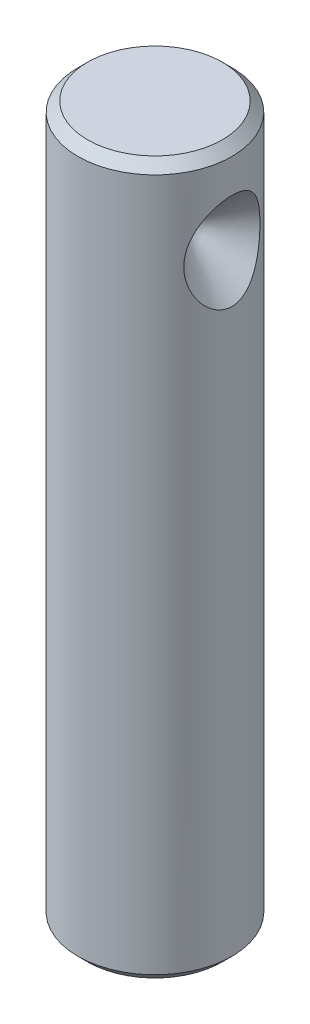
from build123d import *

# Parameters (mm, degrees)
ESQUISSE1_R      = 4
EXTRUSION1_DEPTH = 37
CHANFREIN1_SIZE  = 0.5


with BuildPart() as part:
    # Esquisse1 → Extrusion1 (new body)
    with BuildSketch(Plane(origin=(0, 0, 0), x_dir=(1, 0, 0), z_dir=(0, 1, 0))):
        with Locations(Location((0, 0, 0), (0, 0, 270))):
            Circle(ESQUISSE1_R)
    extrude(amount=EXTRUSION1_DEPTH)

    # Chanfrein1
    chanfrein1_edges = [part.edges().sort_by_distance(p)[0] for p in [
        (0, 0, -4),
        (0, 37, -4),
    ]]
    chamfer(chanfrein1_edges, length=CHANFREIN1_SIZE)

    # Esquisse3 → Enl_vement de mati_re-R_volution7 (revolve, cut)
    with BuildSketch(Plane.XY, mode=Mode.PRIVATE) as enl_vement_de_mati_re_r_volution7_sk:
        Polygon((1.5, 32.25), (5.302166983, 36.052166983), (5.302166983, 32.25), align=None)
    revolve(enl_vement_de_mati_re_r_volution7_sk.sketch.rotate(Axis((6.751846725, 32.25, 0), (-1, 0, 0)), 90), axis=Axis((6.751846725, 32.25, 0), (-1, 0, 0)), mode=Mode.SUBTRACT)


solid = part.part
